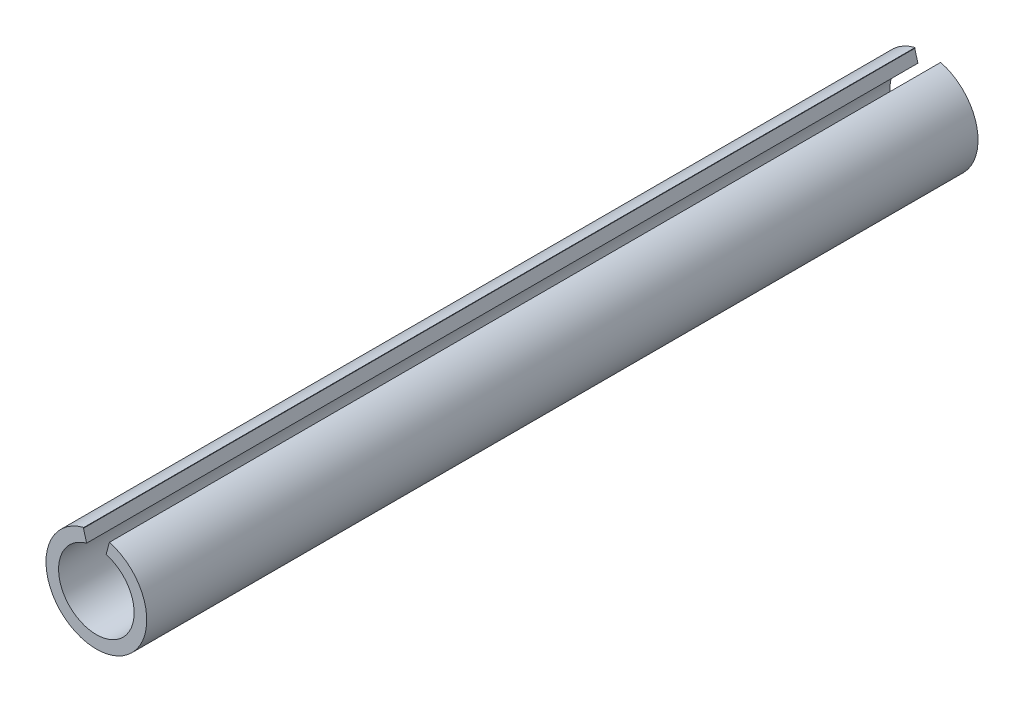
from build123d import *

# Parameters (mm, degrees)
ESQUISSE2_R             = 2
ESQUISSE2_R_2           = 1.5
EXTRUSION1_DEPTH        = 33
ENL_V_MAT_EXTRU_1_DEPTH = 34.120990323


with BuildPart() as part:
    # Esquisse2 → Extrusion1 (new body)
    with BuildSketch(Plane.XY):
        Circle(ESQUISSE2_R)
        Circle(ESQUISSE2_R_2, mode=Mode.SUBTRACT)
    extrude(amount=EXTRUSION1_DEPTH)

    # Esquisse3 → Enl_v. mat.-Extru.1 (cut, through all)
    with BuildSketch(Plane.XY.offset(33)):
        Polygon((-0.509835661, 1.902732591), (0, 0), (0.51763809, 1.931851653), (-0.096385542, 2.891566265), align=None)
    extrude(amount=-ENL_V_MAT_EXTRU_1_DEPTH, mode=Mode.SUBTRACT)


solid = part.part
